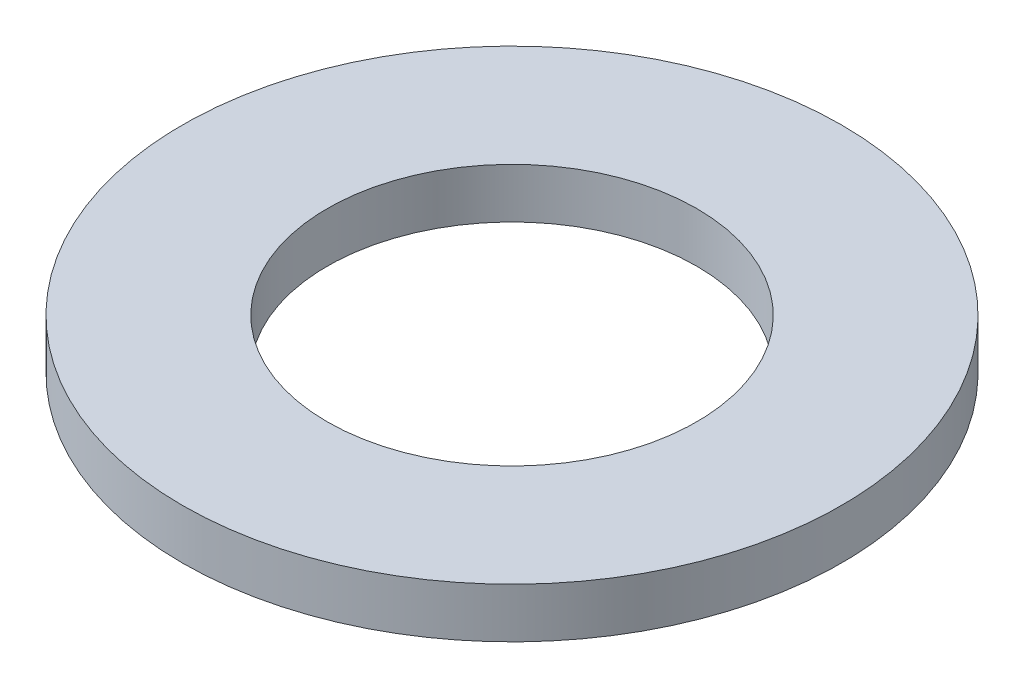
from build123d import *

# Parameters (mm, degrees)
SKETCH1_R      = 33
SKETCH1_R_2    = 18.5
EXTRUDE1_DEPTH = 5


with BuildPart() as part:
    # Sketch1 → Extrude1 (new body)
    with BuildSketch(Plane(origin=(0, 0, 0), x_dir=(1, 0, 0), z_dir=(0, 1, 0))):
        with Locations(Location((0, 0, 0), (0, 0, 270))):
            Circle(SKETCH1_R)
        with Locations(Location((0, 0, 0), (0, 0, 270))):
            Circle(SKETCH1_R_2, mode=Mode.SUBTRACT)
    extrude(amount=EXTRUDE1_DEPTH)


solid = part.part
